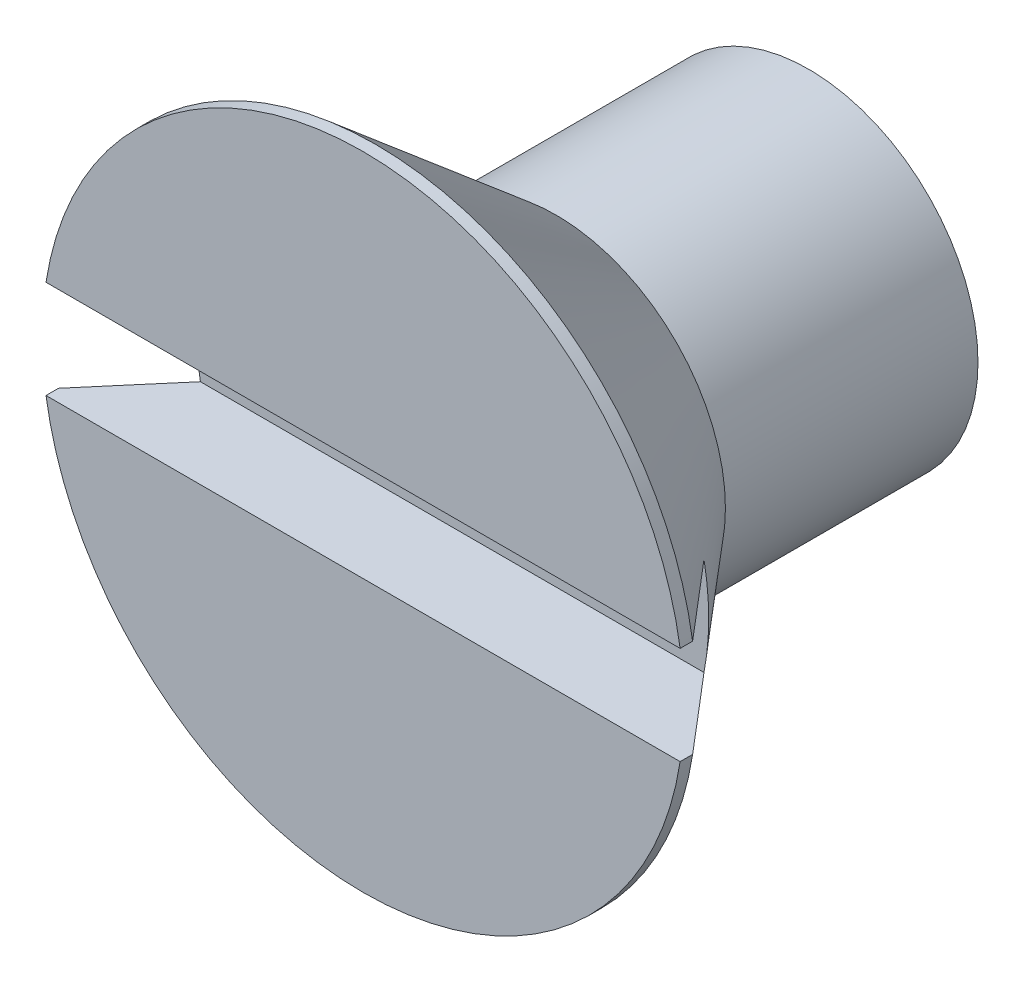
ISO-10303-21;
HEADER;
FILE_DESCRIPTION(('STEP AP214'),'2;1');
FILE_NAME('part.step','',(''),(''),'','','');
FILE_SCHEMA(('AUTOMOTIVE_DESIGN { 1 0 10303 214 1 1 1 1 }'));
ENDSEC;
DATA;
#1=APPLICATION_CONTEXT('core data for automotive mechanical design processes');
#2=APPLICATION_PROTOCOL_DEFINITION('international standard','automotive_design',2000,#1);
#3=PRODUCT_CONTEXT('',#1,'mechanical');
#4=PRODUCT('Part','Part','',(#3));
#5=PRODUCT_RELATED_PRODUCT_CATEGORY('part','',(#4));
#6=PRODUCT_DEFINITION_FORMATION('','',#4);
#7=PRODUCT_DEFINITION_CONTEXT('part definition',#1,'design');
#8=PRODUCT_DEFINITION('design','',#6,#7);
#9=PRODUCT_DEFINITION_SHAPE('','',#8);
#10=(LENGTH_UNIT() NAMED_UNIT(*) SI_UNIT(.MILLI.,.METRE.));
#11=(NAMED_UNIT(*) PLANE_ANGLE_UNIT() SI_UNIT($,.RADIAN.));
#12=(NAMED_UNIT(*) SI_UNIT($,.STERADIAN.) SOLID_ANGLE_UNIT());
#13=UNCERTAINTY_MEASURE_WITH_UNIT(LENGTH_MEASURE(1.E-05),#10,'distance_accuracy_value','');
#14=(GEOMETRIC_REPRESENTATION_CONTEXT(3) GLOBAL_UNCERTAINTY_ASSIGNED_CONTEXT((#13)) GLOBAL_UNIT_ASSIGNED_CONTEXT((#10,
#11,#12)) REPRESENTATION_CONTEXT('',''));
#15=CARTESIAN_POINT('',(0.,0.,0.));
#16=DIRECTION('',(0.,0.,1.));
#17=DIRECTION('',(1.,0.,0.));
#18=AXIS2_PLACEMENT_3D('',#15,#16,#17);
#19=CARTESIAN_POINT('',(0.,0.,0.));
#20=DIRECTION('',(0.,0.,-1.));
#21=DIRECTION('',(-1.,0.,0.));
#22=AXIS2_PLACEMENT_3D('',#19,#20,#21);
#23=PLANE('',#22);
#24=CARTESIAN_POINT('',(0.,0.,0.));
#25=DIRECTION('',(0.,0.,1.));
#26=DIRECTION('',(1.,0.,0.));
#27=AXIS2_PLACEMENT_3D('',#24,#25,#26);
#28=CIRCLE('',#27,4.572);
#29=CARTESIAN_POINT('',(-4.51832731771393,-0.698499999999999,0.));
#30=VERTEX_POINT('',#29);
#31=CARTESIAN_POINT('',(4.51832731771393,-0.698499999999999,0.));
#32=VERTEX_POINT('',#31);
#33=EDGE_CURVE('E161',#30,#32,#28,.T.);
#34=ORIENTED_EDGE('',*,*,#33,.T.);
#35=DIRECTION('',(1.,0.,0.));
#36=VECTOR('',#35,1.);
#37=CARTESIAN_POINT('',(-5.08,-0.698499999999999,0.));
#38=LINE('',#37,#36);
#39=EDGE_CURVE('E184',#30,#32,#38,.T.);
#40=ORIENTED_EDGE('',*,*,#39,.F.);
#41=EDGE_LOOP('',(#34,#40));
#42=FACE_BOUND('',#41,.T.);
#43=ADVANCED_FACE('F37',(#42),#23,.F.);
#44=CARTESIAN_POINT('',(0.,0.,12.9734188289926));
#45=DIRECTION('',(0.,0.,1.));
#46=DIRECTION('',(1.,0.,0.));
#47=AXIS2_PLACEMENT_3D('',#44,#45,#46);
#48=CYLINDRICAL_SURFACE('',#47,4.572);
#49=CARTESIAN_POINT('',(0.,0.,-0.177800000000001));
#50=DIRECTION('',(0.,0.,1.));
#51=DIRECTION('',(1.,0.,0.));
#52=AXIS2_PLACEMENT_3D('',#49,#50,#51);
#53=CIRCLE('',#52,4.572);
#54=CARTESIAN_POINT('',(-4.51832731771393,-0.6985,-0.1778));
#55=VERTEX_POINT('',#54);
#56=CARTESIAN_POINT('',(4.51832731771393,-0.6985,-0.177800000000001));
#57=VERTEX_POINT('',#56);
#58=EDGE_CURVE('E165',#55,#57,#53,.T.);
#59=ORIENTED_EDGE('',*,*,#58,.T.);
#60=DIRECTION('',(0.,0.,1.));
#61=VECTOR('',#60,1.);
#62=CARTESIAN_POINT('',(4.51832731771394,-0.698499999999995,12.9734188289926));
#63=LINE('',#62,#61);
#64=EDGE_CURVE('E176',#57,#32,#63,.T.);
#65=ORIENTED_EDGE('',*,*,#64,.T.);
#66=ORIENTED_EDGE('',*,*,#33,.F.);
#67=DIRECTION('',(0.,0.,1.));
#68=VECTOR('',#67,1.);
#69=CARTESIAN_POINT('',(-4.51832731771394,-0.698499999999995,12.9734188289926));
#70=LINE('',#69,#68);
#71=EDGE_CURVE('E174',#30,#55,#70,.F.);
#72=ORIENTED_EDGE('',*,*,#71,.T.);
#73=EDGE_LOOP('',(#59,#65,#66,#72));
#74=FACE_BOUND('',#73,.T.);
#75=ADVANCED_FACE('F144',(#74),#48,.T.);
#76=CARTESIAN_POINT('',(4.51832731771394,0.698499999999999,0.));
#77=VERTEX_POINT('',#76);
#78=CARTESIAN_POINT('',(-4.51832731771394,0.698499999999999,0.));
#79=VERTEX_POINT('',#78);
#80=EDGE_CURVE('E104',#77,#79,#28,.T.);
#81=ORIENTED_EDGE('',*,*,#80,.T.);
#82=DIRECTION('',(1.,0.,0.));
#83=VECTOR('',#82,1.);
#84=CARTESIAN_POINT('',(-5.08,0.698499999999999,0.));
#85=LINE('',#84,#83);
#86=EDGE_CURVE('E111',#79,#77,#85,.T.);
#87=ORIENTED_EDGE('',*,*,#86,.T.);
#88=EDGE_LOOP('',(#81,#87));
#89=FACE_BOUND('',#88,.T.);
#90=ADVANCED_FACE('F39',(#89),#23,.F.);
#91=CARTESIAN_POINT('',(4.51832731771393,0.6985,-0.1778));
#92=VERTEX_POINT('',#91);
#93=CARTESIAN_POINT('',(-4.51832731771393,0.6985,-0.177800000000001));
#94=VERTEX_POINT('',#93);
#95=EDGE_CURVE('E162',#92,#94,#53,.T.);
#96=ORIENTED_EDGE('',*,*,#95,.T.);
#97=DIRECTION('',(0.,0.,1.));
#98=VECTOR('',#97,1.);
#99=CARTESIAN_POINT('',(-4.51832731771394,0.698499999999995,12.9734188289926));
#100=LINE('',#99,#98);
#101=EDGE_CURVE('E58',#94,#79,#100,.T.);
#102=ORIENTED_EDGE('',*,*,#101,.T.);
#103=ORIENTED_EDGE('',*,*,#80,.F.);
#104=DIRECTION('',(0.,0.,1.));
#105=VECTOR('',#104,1.);
#106=CARTESIAN_POINT('',(4.51832731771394,0.698499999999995,12.9734188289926));
#107=LINE('',#106,#105);
#108=EDGE_CURVE('E179',#77,#92,#107,.F.);
#109=ORIENTED_EDGE('',*,*,#108,.T.);
#110=EDGE_LOOP('',(#96,#102,#103,#109));
#111=FACE_BOUND('',#110,.T.);
#112=ADVANCED_FACE('F140',(#111),#48,.T.);
#113=CARTESIAN_POINT('',(0.,0.,-2.75079600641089));
#114=DIRECTION('',(0.,0.,1.));
#115=DIRECTION('',(1.,0.,0.));
#116=AXIS2_PLACEMENT_3D('',#113,#114,#115);
#117=CONICAL_SURFACE('',#116,2.413,0.698131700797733);
#118=CARTESIAN_POINT('',(0.,0.,-1.27));
#119=DIRECTION('',(0.,0.,-1.));
#120=DIRECTION('',(-1.,0.,0.));
#121=AXIS2_PLACEMENT_3D('',#118,#119,#120);
#122=CIRCLE('',#121,3.65553538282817);
#123=CARTESIAN_POINT('',(3.58818013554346,0.6985,-1.27));
#124=VERTEX_POINT('',#123);
#125=CARTESIAN_POINT('',(3.58818013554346,-0.6985,-1.27));
#126=VERTEX_POINT('',#125);
#127=EDGE_CURVE('E51',#124,#126,#122,.T.);
#128=ORIENTED_EDGE('',*,*,#127,.T.);
#129=CARTESIAN_POINT('',(-9.18199762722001,-0.698499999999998,5.34779856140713));
#130=CARTESIAN_POINT('',(-8.8802694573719,-0.698499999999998,4.98925606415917));
#131=CARTESIAN_POINT('',(-8.57849779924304,-0.698499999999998,4.63075012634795));
#132=CARTESIAN_POINT('',(-7.974812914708,-0.698499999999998,3.91385081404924));
#133=CARTESIAN_POINT('',(-7.67289968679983,-0.698499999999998,3.55545744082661));
#134=CARTESIAN_POINT('',(-7.06875117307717,-0.698499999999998,2.8386733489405));
#135=CARTESIAN_POINT('',(-6.76651580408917,-0.698499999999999,2.48028270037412));
#136=CARTESIAN_POINT('',(-6.16176797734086,-0.698499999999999,1.76374153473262));
#137=CARTESIAN_POINT('',(-5.85925552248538,-0.698499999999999,1.40559101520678));
#138=CARTESIAN_POINT('',(-5.25584955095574,-0.698499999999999,0.692095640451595));
#139=CARTESIAN_POINT('',(-4.95495901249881,-0.698499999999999,0.336748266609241));
#140=CARTESIAN_POINT('',(-4.35245351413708,-0.6985,-0.373351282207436));
#141=CARTESIAN_POINT('',(-4.05083853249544,-0.6985,-0.728103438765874));
#142=CARTESIAN_POINT('',(-3.59743253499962,-0.6985,-1.25929699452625));
#143=CARTESIAN_POINT('',(-3.44615695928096,-0.6985,-1.43617821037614));
#144=CARTESIAN_POINT('',(-3.14309431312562,-0.6985,-1.78950543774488));
#145=CARTESIAN_POINT('',(-2.99130723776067,-0.6985,-1.96595144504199));
#146=CARTESIAN_POINT('',(-2.68695834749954,-0.6985,-2.31815698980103));
#147=CARTESIAN_POINT('',(-2.53439657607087,-0.6985,-2.49391656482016));
#148=CARTESIAN_POINT('',(-2.22800206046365,-0.6985,-2.84432347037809));
#149=CARTESIAN_POINT('',(-2.07416934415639,-0.6985,-3.01897082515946));
#150=CARTESIAN_POINT('',(-1.87629046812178,-0.698500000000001,-3.24055952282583));
#151=CARTESIAN_POINT('',(-1.83333775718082,-0.698500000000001,-3.2884766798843));
#152=CARTESIAN_POINT('',(-1.74720445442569,-0.698500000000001,-3.38410637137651));
#153=CARTESIAN_POINT('',(-1.70402386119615,-0.698500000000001,-3.431818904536));
#154=CARTESIAN_POINT('',(-1.57404274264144,-0.698500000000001,-3.57461144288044));
#155=CARTESIAN_POINT('',(-1.48682957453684,-0.698500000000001,-3.66931637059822));
#156=CARTESIAN_POINT('',(-1.31027848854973,-0.698500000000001,-3.85758084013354));
#157=CARTESIAN_POINT('',(-1.2209325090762,-0.698500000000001,-3.95113290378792));
#158=CARTESIAN_POINT('',(-1.08469271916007,-0.698500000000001,-4.08922557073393));
#159=CARTESIAN_POINT('',(-1.03892232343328,-0.698500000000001,-4.13487153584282));
#160=CARTESIAN_POINT('',(-0.946350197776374,-0.698500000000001,-4.22510225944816));
#161=CARTESIAN_POINT('',(-0.899548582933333,-0.698500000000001,-4.26968713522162));
#162=CARTESIAN_POINT('',(-0.812734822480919,-0.698500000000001,-4.34969526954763));
#163=CARTESIAN_POINT('',(-0.772952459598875,-0.698500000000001,-4.38536668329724));
#164=CARTESIAN_POINT('',(-0.691999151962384,-0.698500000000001,-4.45519029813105));
#165=CARTESIAN_POINT('',(-0.650826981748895,-0.698500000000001,-4.48934109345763));
#166=CARTESIAN_POINT('',(-0.566828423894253,-0.698500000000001,-4.55511418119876));
#167=CARTESIAN_POINT('',(-0.524011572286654,-0.698500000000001,-4.5867485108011));
#168=CARTESIAN_POINT('',(-0.435865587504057,-0.698500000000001,-4.64624221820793));
#169=CARTESIAN_POINT('',(-0.390541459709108,-0.698500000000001,-4.6741087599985));
#170=CARTESIAN_POINT('',(-0.306307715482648,-0.698500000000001,-4.71840333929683));
#171=CARTESIAN_POINT('',(-0.268032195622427,-0.698500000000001,-4.73600486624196));
#172=CARTESIAN_POINT('',(-0.189268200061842,-0.698500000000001,-4.76518007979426));
#173=CARTESIAN_POINT('',(-0.14878765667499,-0.698500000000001,-4.77677397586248));
#174=CARTESIAN_POINT('',(-0.0737393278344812,-0.698500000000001,-4.79037549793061));
#175=CARTESIAN_POINT('',(-0.0394263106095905,-0.698500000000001,-4.79373766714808));
#176=CARTESIAN_POINT('',(0.029243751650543,-0.698500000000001,-4.79433318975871));
#177=CARTESIAN_POINT('',(0.0636007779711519,-0.698500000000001,-4.79156860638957));
#178=CARTESIAN_POINT('',(0.13980005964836,-0.698500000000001,-4.77902232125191));
#179=CARTESIAN_POINT('',(0.181373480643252,-0.698500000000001,-4.76766330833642));
#180=CARTESIAN_POINT('',(0.262246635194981,-0.698500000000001,-4.73852497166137));
#181=CARTESIAN_POINT('',(0.301536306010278,-0.698500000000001,-4.72071941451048));
#182=CARTESIAN_POINT('',(0.394618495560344,-0.698500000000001,-4.67222135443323));
#183=CARTESIAN_POINT('',(0.447216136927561,-0.698500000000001,-4.63930157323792));
#184=CARTESIAN_POINT('',(0.549184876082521,-0.698500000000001,-4.56872466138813));
#185=CARTESIAN_POINT('',(0.598546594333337,-0.698500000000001,-4.53105461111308));
#186=CARTESIAN_POINT('',(0.695376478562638,-0.698500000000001,-4.45264426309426));
#187=CARTESIAN_POINT('',(0.742827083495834,-0.698500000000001,-4.41188250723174));
#188=CARTESIAN_POINT('',(0.836068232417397,-0.698500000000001,-4.3286539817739));
#189=CARTESIAN_POINT('',(0.881861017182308,-0.698500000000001,-4.28618969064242));
#190=CARTESIAN_POINT('',(0.980284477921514,-0.698500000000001,-4.19250839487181));
#191=CARTESIAN_POINT('',(1.0327000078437,-0.698500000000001,-4.14106637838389));
#192=CARTESIAN_POINT('',(1.13645329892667,-0.698500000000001,-4.0371037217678));
#193=CARTESIAN_POINT('',(1.18779095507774,-0.698500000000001,-3.98458297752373));
#194=CARTESIAN_POINT('',(1.34068627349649,-0.698500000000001,-3.82588459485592));
#195=CARTESIAN_POINT('',(1.44109427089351,-0.698500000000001,-3.71860216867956));
#196=CARTESIAN_POINT('',(1.64033159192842,-0.698500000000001,-3.50231944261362));
#197=CARTESIAN_POINT('',(1.73915851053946,-0.698500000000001,-3.39331694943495));
#198=CARTESIAN_POINT('',(1.93571164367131,-0.698500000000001,-3.17436118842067));
#199=CARTESIAN_POINT('',(2.03343805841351,-0.6985,-3.06440810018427));
#200=CARTESIAN_POINT('',(2.22755814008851,-0.6985,-2.844572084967));
#201=CARTESIAN_POINT('',(2.32395632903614,-0.6985,-2.73469314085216));
#202=CARTESIAN_POINT('',(2.51626217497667,-0.6985,-2.51449784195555));
#203=CARTESIAN_POINT('',(2.61216980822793,-0.6985,-2.40418146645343));
#204=CARTESIAN_POINT('',(2.89922466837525,-0.6985,-2.07293340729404));
#205=CARTESIAN_POINT('',(3.08984327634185,-0.6985,-1.85154396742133));
#206=CARTESIAN_POINT('',(3.52692503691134,-0.6985,-1.34206779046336));
#207=CARTESIAN_POINT('',(3.77311696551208,-0.6985,-1.05374881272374));
#208=CARTESIAN_POINT('',(4.26475858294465,-0.6985,-0.476475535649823));
#209=CARTESIAN_POINT('',(4.51020826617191,-0.6985,-0.187521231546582));
#210=CARTESIAN_POINT('',(5.24604316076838,-0.698499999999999,0.680082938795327));
#211=CARTESIAN_POINT('',(5.73576298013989,-0.698499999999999,1.25929684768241));
#212=CARTESIAN_POINT('',(6.71856334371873,-0.698499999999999,2.42327934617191));
#213=CARTESIAN_POINT('',(7.21163729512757,-0.698499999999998,3.00805349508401));
#214=CARTESIAN_POINT('',(7.95083581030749,-0.698499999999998,3.8853987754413));
#215=CARTESIAN_POINT('',(8.19712634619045,-0.698499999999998,4.17783005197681));
#216=CARTESIAN_POINT('',(8.68962082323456,-0.698499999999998,4.76276502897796));
#217=CARTESIAN_POINT('',(8.93582476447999,-0.698499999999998,5.05526872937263));
#218=CARTESIAN_POINT('',(9.18199762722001,-0.698499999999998,5.34779856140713));
#219=B_SPLINE_CURVE_WITH_KNOTS('',3,(#129,#130,#131,#132,#133,#134,#135,#136,#137,#138,#139,
#140,#141,#142,#143,#144,#145,#146,#147,#148,#149,#150,#151,#152,#153,#154,#155,#156,#157,#158,
#159,#160,#161,#162,#163,#164,#165,#166,#167,#168,#169,#170,#171,#172,#173,#174,#175,#176,#177,
#178,#179,#180,#181,#182,#183,#184,#185,#186,#187,#188,#189,#190,#191,#192,#193,#194,#195,#196,
#197,#198,#199,#200,#201,#202,#203,#204,#205,#206,#207,#208,#209,#210,#211,#212,#213,#214,#215,
#216,#217,#218),.UNSPECIFIED.,.F.,.F.,(4,2,2,2,2,2,2,2,2,2,2,2,2,2,2,2,2,2,2,2,2,2,2,2,2,2,2,2,
2,2,2,2,2,2,2,2,2,2,2,2,2,2,2,2,4),(0.,1.40582133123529,2.81165793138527,4.21811108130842,
5.62454965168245,7.02142510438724,8.41834300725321,9.11658412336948,9.8148319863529,
10.5130410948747,11.2112349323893,11.4042858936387,11.5973380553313,11.9835628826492,
12.3716035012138,12.5655162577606,12.7594074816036,12.9196807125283,13.0800991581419,
13.239697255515,13.3989874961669,13.5250506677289,13.6506869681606,13.7536004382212,
13.8564792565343,13.9850014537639,14.1140526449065,14.2996906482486,14.4858448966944,
14.6734363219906,14.8607639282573,15.0810639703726,15.3013853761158,15.7421625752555,
16.1835564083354,16.6248685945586,17.0633801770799,17.5019127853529,18.3783440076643,
19.5157270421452,20.6531186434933,22.9286007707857,25.2233216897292,26.3703071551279,
27.517291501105),.UNSPECIFIED.);
#220=EDGE_CURVE('E11',#126,#57,#219,.T.);
#221=ORIENTED_EDGE('',*,*,#220,.T.);
#222=ORIENTED_EDGE('',*,*,#58,.F.);
#223=CARTESIAN_POINT('',(-3.58818013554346,-0.6985,-1.27));
#224=VERTEX_POINT('',#223);
#225=EDGE_CURVE('E41',#55,#224,#219,.T.);
#226=ORIENTED_EDGE('',*,*,#225,.T.);
#227=CARTESIAN_POINT('',(-3.58818013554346,0.6985,-1.27));
#228=VERTEX_POINT('',#227);
#229=EDGE_CURVE('E103',#224,#228,#122,.T.);
#230=ORIENTED_EDGE('',*,*,#229,.T.);
#231=CARTESIAN_POINT('',(9.18199762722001,0.698499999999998,5.34779856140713));
#232=CARTESIAN_POINT('',(8.8802694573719,0.698499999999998,4.98925606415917));
#233=CARTESIAN_POINT('',(8.57849779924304,0.698499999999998,4.63075012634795));
#234=CARTESIAN_POINT('',(7.974812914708,0.698499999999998,3.91385081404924));
#235=CARTESIAN_POINT('',(7.67289968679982,0.698499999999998,3.55545744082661));
#236=CARTESIAN_POINT('',(7.06875117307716,0.698499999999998,2.8386733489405));
#237=CARTESIAN_POINT('',(6.76651580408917,0.698499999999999,2.48028270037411));
#238=CARTESIAN_POINT('',(6.16176797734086,0.698499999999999,1.76374153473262));
#239=CARTESIAN_POINT('',(5.85925552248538,0.698499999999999,1.40559101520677));
#240=CARTESIAN_POINT('',(5.25584955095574,0.698499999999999,0.692095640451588));
#241=CARTESIAN_POINT('',(4.95495901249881,0.698499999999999,0.336748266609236));
#242=CARTESIAN_POINT('',(4.35245351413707,0.6985,-0.37335128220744));
#243=CARTESIAN_POINT('',(4.05083853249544,0.6985,-0.728103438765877));
#244=CARTESIAN_POINT('',(3.59743253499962,0.6985,-1.25929699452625));
#245=CARTESIAN_POINT('',(3.44615695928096,0.6985,-1.43617821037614));
#246=CARTESIAN_POINT('',(3.14309431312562,0.6985,-1.78950543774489));
#247=CARTESIAN_POINT('',(2.99130723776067,0.6985,-1.96595144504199));
#248=CARTESIAN_POINT('',(2.68695834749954,0.6985,-2.31815698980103));
#249=CARTESIAN_POINT('',(2.53439657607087,0.6985,-2.49391656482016));
#250=CARTESIAN_POINT('',(2.22800206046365,0.6985,-2.84432347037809));
#251=CARTESIAN_POINT('',(2.07416934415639,0.6985,-3.01897082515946));
#252=CARTESIAN_POINT('',(1.87629046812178,0.698500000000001,-3.24055952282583));
#253=CARTESIAN_POINT('',(1.83333775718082,0.698500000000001,-3.2884766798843));
#254=CARTESIAN_POINT('',(1.74720445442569,0.698500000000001,-3.38410637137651));
#255=CARTESIAN_POINT('',(1.70402386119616,0.698500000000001,-3.431818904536));
#256=CARTESIAN_POINT('',(1.57404274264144,0.698500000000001,-3.57461144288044));
#257=CARTESIAN_POINT('',(1.48682957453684,0.698500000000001,-3.66931637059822));
#258=CARTESIAN_POINT('',(1.31027848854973,0.698500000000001,-3.85758084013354));
#259=CARTESIAN_POINT('',(1.22093250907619,0.698500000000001,-3.95113290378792));
#260=CARTESIAN_POINT('',(1.08469271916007,0.698500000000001,-4.08922557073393));
#261=CARTESIAN_POINT('',(1.03892232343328,0.698500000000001,-4.13487153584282));
#262=CARTESIAN_POINT('',(0.946350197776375,0.698500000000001,-4.22510225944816));
#263=CARTESIAN_POINT('',(0.899548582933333,0.698500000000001,-4.26968713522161));
#264=CARTESIAN_POINT('',(0.812734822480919,0.698500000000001,-4.34969526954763));
#265=CARTESIAN_POINT('',(0.772952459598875,0.698500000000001,-4.38536668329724));
#266=CARTESIAN_POINT('',(0.691999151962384,0.698500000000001,-4.45519029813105));
#267=CARTESIAN_POINT('',(0.650826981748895,0.698500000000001,-4.48934109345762));
#268=CARTESIAN_POINT('',(0.566828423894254,0.698500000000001,-4.55511418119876));
#269=CARTESIAN_POINT('',(0.524011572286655,0.698500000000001,-4.5867485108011));
#270=CARTESIAN_POINT('',(0.435865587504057,0.698500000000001,-4.64624221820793));
#271=CARTESIAN_POINT('',(0.390541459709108,0.698500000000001,-4.6741087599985));
#272=CARTESIAN_POINT('',(0.306307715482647,0.698500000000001,-4.71840333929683));
#273=CARTESIAN_POINT('',(0.268032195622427,0.698500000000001,-4.73600486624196));
#274=CARTESIAN_POINT('',(0.189268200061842,0.698500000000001,-4.76518007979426));
#275=CARTESIAN_POINT('',(0.14878765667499,0.698500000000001,-4.77677397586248));
#276=CARTESIAN_POINT('',(0.0737393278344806,0.698500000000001,-4.79037549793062));
#277=CARTESIAN_POINT('',(0.0394263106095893,0.698500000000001,-4.79373766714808));
#278=CARTESIAN_POINT('',(-0.0292437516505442,0.698500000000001,-4.79433318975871));
#279=CARTESIAN_POINT('',(-0.0636007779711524,0.698500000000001,-4.79156860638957));
#280=CARTESIAN_POINT('',(-0.13980005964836,0.698500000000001,-4.77902232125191));
#281=CARTESIAN_POINT('',(-0.181373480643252,0.698500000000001,-4.76766330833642));
#282=CARTESIAN_POINT('',(-0.262246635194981,0.698500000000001,-4.73852497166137));
#283=CARTESIAN_POINT('',(-0.301536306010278,0.698500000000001,-4.72071941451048));
#284=CARTESIAN_POINT('',(-0.394618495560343,0.698500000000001,-4.67222135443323));
#285=CARTESIAN_POINT('',(-0.44721613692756,0.698500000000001,-4.63930157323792));
#286=CARTESIAN_POINT('',(-0.54918487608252,0.698500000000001,-4.56872466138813));
#287=CARTESIAN_POINT('',(-0.598546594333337,0.698500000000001,-4.53105461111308));
#288=CARTESIAN_POINT('',(-0.695376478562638,0.698500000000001,-4.45264426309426));
#289=CARTESIAN_POINT('',(-0.742827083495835,0.698500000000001,-4.41188250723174));
#290=CARTESIAN_POINT('',(-0.836068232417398,0.698500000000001,-4.3286539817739));
#291=CARTESIAN_POINT('',(-0.881861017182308,0.698500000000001,-4.28618969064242));
#292=CARTESIAN_POINT('',(-0.980284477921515,0.698500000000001,-4.19250839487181));
#293=CARTESIAN_POINT('',(-1.0327000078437,0.698500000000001,-4.14106637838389));
#294=CARTESIAN_POINT('',(-1.13645329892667,0.698500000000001,-4.0371037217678));
#295=CARTESIAN_POINT('',(-1.18779095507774,0.698500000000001,-3.98458297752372));
#296=CARTESIAN_POINT('',(-1.34068627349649,0.698500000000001,-3.82588459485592));
#297=CARTESIAN_POINT('',(-1.44109427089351,0.698500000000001,-3.71860216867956));
#298=CARTESIAN_POINT('',(-1.64033159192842,0.698500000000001,-3.50231944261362));
#299=CARTESIAN_POINT('',(-1.73915851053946,0.698500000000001,-3.39331694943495));
#300=CARTESIAN_POINT('',(-1.93571164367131,0.698500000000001,-3.17436118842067));
#301=CARTESIAN_POINT('',(-2.03343805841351,0.6985,-3.06440810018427));
#302=CARTESIAN_POINT('',(-2.22755814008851,0.6985,-2.844572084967));
#303=CARTESIAN_POINT('',(-2.32395632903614,0.6985,-2.73469314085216));
#304=CARTESIAN_POINT('',(-2.51626217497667,0.6985,-2.51449784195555));
#305=CARTESIAN_POINT('',(-2.61216980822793,0.6985,-2.40418146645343));
#306=CARTESIAN_POINT('',(-2.89922466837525,0.6985,-2.07293340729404));
#307=CARTESIAN_POINT('',(-3.08984327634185,0.6985,-1.85154396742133));
#308=CARTESIAN_POINT('',(-3.52692503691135,0.6985,-1.34206779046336));
#309=CARTESIAN_POINT('',(-3.77311696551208,0.6985,-1.05374881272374));
#310=CARTESIAN_POINT('',(-4.26475858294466,0.6985,-0.476475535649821));
#311=CARTESIAN_POINT('',(-4.51020826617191,0.6985,-0.187521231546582));
#312=CARTESIAN_POINT('',(-5.24604316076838,0.698499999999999,0.680082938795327));
#313=CARTESIAN_POINT('',(-5.73576298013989,0.698499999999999,1.25929684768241));
#314=CARTESIAN_POINT('',(-6.71856334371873,0.698499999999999,2.42327934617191));
#315=CARTESIAN_POINT('',(-7.21163729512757,0.698499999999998,3.00805349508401));
#316=CARTESIAN_POINT('',(-7.95083581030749,0.698499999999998,3.8853987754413));
#317=CARTESIAN_POINT('',(-8.19712634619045,0.698499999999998,4.17783005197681));
#318=CARTESIAN_POINT('',(-8.68962082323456,0.698499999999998,4.76276502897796));
#319=CARTESIAN_POINT('',(-8.93582476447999,0.698499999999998,5.05526872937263));
#320=CARTESIAN_POINT('',(-9.18199762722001,0.698499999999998,5.34779856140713));
#321=B_SPLINE_CURVE_WITH_KNOTS('',3,(#231,#232,#233,#234,#235,#236,#237,#238,#239,#240,#241,
#242,#243,#244,#245,#246,#247,#248,#249,#250,#251,#252,#253,#254,#255,#256,#257,#258,#259,#260,
#261,#262,#263,#264,#265,#266,#267,#268,#269,#270,#271,#272,#273,#274,#275,#276,#277,#278,#279,
#280,#281,#282,#283,#284,#285,#286,#287,#288,#289,#290,#291,#292,#293,#294,#295,#296,#297,#298,
#299,#300,#301,#302,#303,#304,#305,#306,#307,#308,#309,#310,#311,#312,#313,#314,#315,#316,#317,
#318,#319,#320),.UNSPECIFIED.,.F.,.F.,(4,2,2,2,2,2,2,2,2,2,2,2,2,2,2,2,2,2,2,2,2,2,2,2,2,2,2,2,
2,2,2,2,2,2,2,2,2,2,2,2,2,2,2,2,4),(0.,1.40582133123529,2.81165793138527,4.21811108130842,
5.62454965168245,7.02142510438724,8.41834300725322,9.11658412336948,9.8148319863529,
10.5130410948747,11.2112349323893,11.4042858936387,11.5973380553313,11.9835628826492,
12.3716035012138,12.5655162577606,12.7594074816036,12.9196807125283,13.0800991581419,
13.239697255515,13.3989874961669,13.5250506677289,13.6506869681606,13.7536004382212,
13.8564792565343,13.9850014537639,14.1140526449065,14.2996906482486,14.4858448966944,
14.6734363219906,14.8607639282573,15.0810639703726,15.3013853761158,15.7421625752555,
16.1835564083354,16.6248685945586,17.0633801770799,17.5019127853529,18.3783440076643,
19.5157270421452,20.6531186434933,22.9286007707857,25.2233216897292,26.3703071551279,
27.517291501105),.UNSPECIFIED.);
#322=EDGE_CURVE('E94',#228,#94,#321,.T.);
#323=ORIENTED_EDGE('',*,*,#322,.T.);
#324=ORIENTED_EDGE('',*,*,#95,.F.);
#325=EDGE_CURVE('E106',#92,#124,#321,.T.);
#326=ORIENTED_EDGE('',*,*,#325,.T.);
#327=EDGE_LOOP('',(#128,#221,#222,#226,#230,#323,#324,#326));
#328=FACE_BOUND('',#327,.T.);
#329=CARTESIAN_POINT('',(0.,0.,-2.75079600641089));
#330=DIRECTION('',(0.,0.,1.));
#331=DIRECTION('',(1.,0.,0.));
#332=AXIS2_PLACEMENT_3D('',#329,#330,#331);
#333=CIRCLE('',#332,2.413);
#334=CARTESIAN_POINT('',(2.413,0.,-2.75079600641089));
#335=VERTEX_POINT('',#334);
#336=EDGE_CURVE('E167',#335,#335,#333,.T.);
#337=ORIENTED_EDGE('',*,*,#336,.T.);
#338=EDGE_LOOP('',(#337));
#339=FACE_BOUND('',#338,.T.);
#340=ADVANCED_FACE('F113',(#328,#339),#117,.T.);
#341=CARTESIAN_POINT('',(0.,0.,12.9734188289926));
#342=DIRECTION('',(0.,0.,1.));
#343=DIRECTION('',(1.,0.,0.));
#344=AXIS2_PLACEMENT_3D('',#341,#342,#343);
#345=CYLINDRICAL_SURFACE('',#344,2.413);
#346=ORIENTED_EDGE('',*,*,#336,.F.);
#347=EDGE_LOOP('',(#346));
#348=FACE_BOUND('',#347,.T.);
#349=CARTESIAN_POINT('',(0.,0.,-6.35));
#350=DIRECTION('',(0.,0.,1.));
#351=DIRECTION('',(1.,0.,0.));
#352=AXIS2_PLACEMENT_3D('',#349,#350,#351);
#353=CIRCLE('',#352,2.413);
#354=CARTESIAN_POINT('',(2.413,0.,-6.35));
#355=VERTEX_POINT('',#354);
#356=EDGE_CURVE('E171',#355,#355,#353,.T.);
#357=ORIENTED_EDGE('',*,*,#356,.T.);
#358=EDGE_LOOP('',(#357));
#359=FACE_BOUND('',#358,.T.);
#360=ADVANCED_FACE('F133',(#348,#359),#345,.T.);
#361=CARTESIAN_POINT('',(0.,2.413,-6.35));
#362=DIRECTION('',(0.,0.,1.));
#363=DIRECTION('',(1.,0.,0.));
#364=AXIS2_PLACEMENT_3D('',#361,#362,#363);
#365=PLANE('',#364);
#366=ORIENTED_EDGE('',*,*,#356,.F.);
#367=EDGE_LOOP('',(#366));
#368=FACE_BOUND('',#367,.T.);
#369=ADVANCED_FACE('F131',(#368),#365,.F.);
#370=CARTESIAN_POINT('',(-5.08,0.6985,-1.27));
#371=DIRECTION('',(0.,0.,-1.));
#372=DIRECTION('',(-1.,0.,0.));
#373=AXIS2_PLACEMENT_3D('',#370,#371,#372);
#374=PLANE('',#373);
#375=DIRECTION('',(1.,0.,0.));
#376=VECTOR('',#375,1.);
#377=CARTESIAN_POINT('',(-5.08,0.6985,-1.27));
#378=LINE('',#377,#376);
#379=EDGE_CURVE('E97',#228,#124,#378,.T.);
#380=ORIENTED_EDGE('',*,*,#379,.F.);
#381=ORIENTED_EDGE('',*,*,#229,.F.);
#382=DIRECTION('',(1.,0.,0.));
#383=VECTOR('',#382,1.);
#384=CARTESIAN_POINT('',(-5.08,-0.6985,-1.27));
#385=LINE('',#384,#383);
#386=EDGE_CURVE('E181',#224,#126,#385,.T.);
#387=ORIENTED_EDGE('',*,*,#386,.T.);
#388=ORIENTED_EDGE('',*,*,#127,.F.);
#389=EDGE_LOOP('',(#380,#381,#387,#388));
#390=FACE_BOUND('',#389,.T.);
#391=ADVANCED_FACE('F108',(#390),#374,.F.);
#392=CARTESIAN_POINT('',(-5.08,-0.6985,-1.27));
#393=DIRECTION('',(0.,-1.,0.));
#394=DIRECTION('',(0.,0.,-1.));
#395=AXIS2_PLACEMENT_3D('',#392,#393,#394);
#396=PLANE('',#395);
#397=ORIENTED_EDGE('',*,*,#39,.T.);
#398=ORIENTED_EDGE('',*,*,#64,.F.);
#399=ORIENTED_EDGE('',*,*,#220,.F.);
#400=ORIENTED_EDGE('',*,*,#386,.F.);
#401=ORIENTED_EDGE('',*,*,#225,.F.);
#402=ORIENTED_EDGE('',*,*,#71,.F.);
#403=EDGE_LOOP('',(#397,#398,#399,#400,#401,#402));
#404=FACE_BOUND('',#403,.T.);
#405=ADVANCED_FACE('F127',(#404),#396,.F.);
#406=CARTESIAN_POINT('',(-5.08,0.6985,-1.27));
#407=DIRECTION('',(0.,1.,0.));
#408=DIRECTION('',(0.,0.,1.));
#409=AXIS2_PLACEMENT_3D('',#406,#407,#408);
#410=PLANE('',#409);
#411=ORIENTED_EDGE('',*,*,#86,.F.);
#412=ORIENTED_EDGE('',*,*,#101,.F.);
#413=ORIENTED_EDGE('',*,*,#322,.F.);
#414=ORIENTED_EDGE('',*,*,#379,.T.);
#415=ORIENTED_EDGE('',*,*,#325,.F.);
#416=ORIENTED_EDGE('',*,*,#108,.F.);
#417=EDGE_LOOP('',(#411,#412,#413,#414,#415,#416));
#418=FACE_BOUND('',#417,.T.);
#419=ADVANCED_FACE('F96',(#418),#410,.F.);
#420=CLOSED_SHELL('',(#43,#75,#90,#112,#340,#360,#369,#391,#405,#419));
#421=MANIFOLD_SOLID_BREP('B2',#420);
#422=ADVANCED_BREP_SHAPE_REPRESENTATION('',(#18,#421),#14);
#423=SHAPE_DEFINITION_REPRESENTATION(#9,#422);
ENDSEC;
END-ISO-10303-21;
